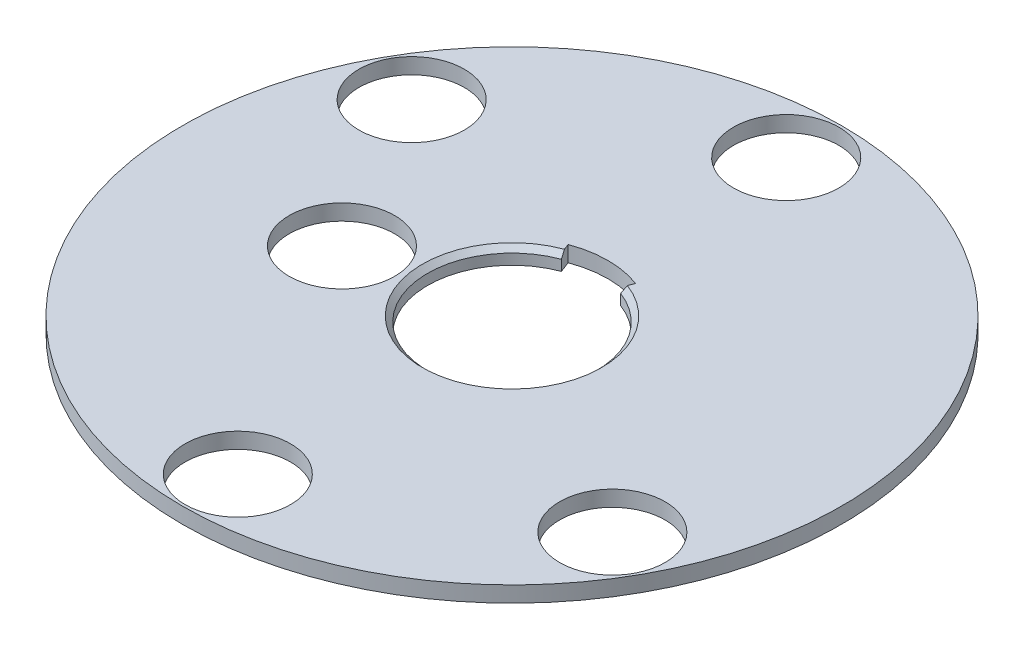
ISO-10303-21;
HEADER;
FILE_DESCRIPTION(('STEP AP214'),'2;1');
FILE_NAME('part.step','',(''),(''),'','','');
FILE_SCHEMA(('AUTOMOTIVE_DESIGN { 1 0 10303 214 1 1 1 1 }'));
ENDSEC;
DATA;
#1=APPLICATION_CONTEXT('core data for automotive mechanical design processes');
#2=APPLICATION_PROTOCOL_DEFINITION('international standard','automotive_design',2000,#1);
#3=PRODUCT_CONTEXT('',#1,'mechanical');
#4=PRODUCT('Part','Part','',(#3));
#5=PRODUCT_RELATED_PRODUCT_CATEGORY('part','',(#4));
#6=PRODUCT_DEFINITION_FORMATION('','',#4);
#7=PRODUCT_DEFINITION_CONTEXT('part definition',#1,'design');
#8=PRODUCT_DEFINITION('design','',#6,#7);
#9=PRODUCT_DEFINITION_SHAPE('','',#8);
#10=(LENGTH_UNIT() NAMED_UNIT(*) SI_UNIT(.MILLI.,.METRE.));
#11=(NAMED_UNIT(*) PLANE_ANGLE_UNIT() SI_UNIT($,.RADIAN.));
#12=(NAMED_UNIT(*) SI_UNIT($,.STERADIAN.) SOLID_ANGLE_UNIT());
#13=UNCERTAINTY_MEASURE_WITH_UNIT(LENGTH_MEASURE(1.E-05),#10,'distance_accuracy_value','');
#14=(GEOMETRIC_REPRESENTATION_CONTEXT(3) GLOBAL_UNCERTAINTY_ASSIGNED_CONTEXT((#13)) GLOBAL_UNIT_ASSIGNED_CONTEXT((#10,
#11,#12)) REPRESENTATION_CONTEXT('',''));
#15=CARTESIAN_POINT('',(0.,0.,0.));
#16=DIRECTION('',(0.,0.,1.));
#17=DIRECTION('',(1.,0.,0.));
#18=AXIS2_PLACEMENT_3D('',#15,#16,#17);
#19=CARTESIAN_POINT('',(0.,-1.5,0.));
#20=DIRECTION('',(0.,1.,0.));
#21=DIRECTION('',(0.,0.,1.));
#22=AXIS2_PLACEMENT_3D('',#19,#20,#21);
#23=CYLINDRICAL_SURFACE('',#22,31.25);
#24=CARTESIAN_POINT('',(0.,-1.5,0.));
#25=DIRECTION('',(0.,1.,0.));
#26=DIRECTION('',(0.,0.,1.));
#27=AXIS2_PLACEMENT_3D('',#24,#25,#26);
#28=CIRCLE('',#27,31.25);
#29=CARTESIAN_POINT('',(0.,-1.5,31.25));
#30=VERTEX_POINT('',#29);
#31=EDGE_CURVE('E120',#30,#30,#28,.T.);
#32=ORIENTED_EDGE('',*,*,#31,.T.);
#33=EDGE_LOOP('',(#32));
#34=FACE_BOUND('',#33,.T.);
#35=CARTESIAN_POINT('',(0.,0.,0.));
#36=DIRECTION('',(0.,1.,0.));
#37=DIRECTION('',(0.,0.,1.));
#38=AXIS2_PLACEMENT_3D('',#35,#36,#37);
#39=CIRCLE('',#38,31.25);
#40=CARTESIAN_POINT('',(0.,0.,31.25));
#41=VERTEX_POINT('',#40);
#42=EDGE_CURVE('E115',#41,#41,#39,.T.);
#43=ORIENTED_EDGE('',*,*,#42,.F.);
#44=EDGE_LOOP('',(#43));
#45=FACE_BOUND('',#44,.T.);
#46=ADVANCED_FACE('F32',(#34,#45),#23,.T.);
#47=CARTESIAN_POINT('',(0.,-1.5,0.));
#48=DIRECTION('',(0.,1.,0.));
#49=DIRECTION('',(0.,0.,1.));
#50=AXIS2_PLACEMENT_3D('',#47,#48,#49);
#51=PLANE('',#50);
#52=CARTESIAN_POINT('',(-13.8063819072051,-1.5,2.32030571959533));
#53=DIRECTION('',(0.,1.,0.));
#54=DIRECTION('',(0.,0.,1.));
#55=AXIS2_PLACEMENT_3D('',#52,#53,#54);
#56=CIRCLE('',#55,5.00000000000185);
#57=CARTESIAN_POINT('',(-13.8063819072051,-1.5,7.32030571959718));
#58=VERTEX_POINT('',#57);
#59=EDGE_CURVE('E185',#58,#58,#56,.T.);
#60=ORIENTED_EDGE('',*,*,#59,.T.);
#61=EDGE_LOOP('',(#60));
#62=FACE_BOUND('',#61,.T.);
#63=CARTESIAN_POINT('',(-22.5166604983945,-1.5,-12.9999999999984));
#64=DIRECTION('',(0.,1.,0.));
#65=DIRECTION('',(0.,0.,1.));
#66=AXIS2_PLACEMENT_3D('',#63,#64,#65);
#67=CIRCLE('',#66,5.0000000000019);
#68=CARTESIAN_POINT('',(-22.5166604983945,-1.5,-7.99999999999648));
#69=VERTEX_POINT('',#68);
#70=EDGE_CURVE('E189',#69,#69,#67,.T.);
#71=ORIENTED_EDGE('',*,*,#70,.T.);
#72=EDGE_LOOP('',(#71));
#73=FACE_BOUND('',#72,.T.);
#74=CARTESIAN_POINT('',(3.68845406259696E-12,-1.5,26.));
#75=DIRECTION('',(0.,1.,0.));
#76=DIRECTION('',(0.,0.,1.));
#77=AXIS2_PLACEMENT_3D('',#74,#75,#76);
#78=CIRCLE('',#77,5.0000000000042);
#79=CARTESIAN_POINT('',(3.68845406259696E-12,-1.5,31.0000000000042));
#80=VERTEX_POINT('',#79);
#81=EDGE_CURVE('E198',#80,#80,#78,.T.);
#82=ORIENTED_EDGE('',*,*,#81,.T.);
#83=EDGE_LOOP('',(#82));
#84=FACE_BOUND('',#83,.T.);
#85=CARTESIAN_POINT('',(22.5166604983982,-1.5,12.9999999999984));
#86=DIRECTION('',(0.,1.,0.));
#87=DIRECTION('',(0.,0.,1.));
#88=AXIS2_PLACEMENT_3D('',#85,#86,#87);
#89=CIRCLE('',#88,5.00000000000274);
#90=CARTESIAN_POINT('',(22.5166604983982,-1.5,18.0000000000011));
#91=VERTEX_POINT('',#90);
#92=EDGE_CURVE('E204',#91,#91,#89,.T.);
#93=ORIENTED_EDGE('',*,*,#92,.T.);
#94=EDGE_LOOP('',(#93));
#95=FACE_BOUND('',#94,.T.);
#96=CARTESIAN_POINT('',(0.,-1.5,-26.));
#97=DIRECTION('',(0.,1.,0.));
#98=DIRECTION('',(0.,0.,1.));
#99=AXIS2_PLACEMENT_3D('',#96,#97,#98);
#100=CIRCLE('',#99,5.);
#101=CARTESIAN_POINT('',(0.,-1.5,-21.));
#102=VERTEX_POINT('',#101);
#103=EDGE_CURVE('E105',#102,#102,#100,.T.);
#104=ORIENTED_EDGE('',*,*,#103,.T.);
#105=EDGE_LOOP('',(#104));
#106=FACE_BOUND('',#105,.T.);
#107=CARTESIAN_POINT('',(0.,-1.5,0.));
#108=DIRECTION('',(0.,1.,0.));
#109=DIRECTION('',(0.,0.,1.));
#110=AXIS2_PLACEMENT_3D('',#107,#108,#109);
#111=CIRCLE('',#110,8.);
#112=CARTESIAN_POINT('',(-2.80898753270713,-1.5,-7.49063342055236));
#113=VERTEX_POINT('',#112);
#114=CARTESIAN_POINT('',(2.80898753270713,-1.5,-7.49063342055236));
#115=VERTEX_POINT('',#114);
#116=EDGE_CURVE('E87',#113,#115,#111,.T.);
#117=ORIENTED_EDGE('',*,*,#116,.T.);
#118=DIRECTION('',(0.351123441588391,0.,-0.936329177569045));
#119=VECTOR('',#118,1.);
#120=CARTESIAN_POINT('',(3.,-1.5,-8.));
#121=LINE('',#120,#119);
#122=CARTESIAN_POINT('',(3.19522331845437,-1.5,-8.5205955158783));
#123=VERTEX_POINT('',#122);
#124=EDGE_CURVE('E80',#115,#123,#121,.T.);
#125=ORIENTED_EDGE('',*,*,#124,.T.);
#126=CARTESIAN_POINT('',(0.,-1.5,0.));
#127=DIRECTION('',(0.,1.,0.));
#128=DIRECTION('',(0.,0.,1.));
#129=AXIS2_PLACEMENT_3D('',#126,#127,#128);
#130=CIRCLE('',#129,9.1);
#131=CARTESIAN_POINT('',(-3.19522331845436,-1.5,-8.52059551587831));
#132=VERTEX_POINT('',#131);
#133=EDGE_CURVE('E91',#123,#132,#130,.T.);
#134=ORIENTED_EDGE('',*,*,#133,.T.);
#135=DIRECTION('',(0.351123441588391,0.,0.936329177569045));
#136=VECTOR('',#135,1.);
#137=CARTESIAN_POINT('',(-3.,-1.5,-8.));
#138=LINE('',#137,#136);
#139=EDGE_CURVE('E95',#132,#113,#138,.T.);
#140=ORIENTED_EDGE('',*,*,#139,.T.);
#141=EDGE_LOOP('',(#117,#125,#134,#140));
#142=FACE_BOUND('',#141,.T.);
#143=ORIENTED_EDGE('',*,*,#31,.F.);
#144=EDGE_LOOP('',(#143));
#145=FACE_BOUND('',#144,.T.);
#146=ADVANCED_FACE('F98',(#62,#73,#84,#95,#106,#142,#145),#51,.F.);
#147=CARTESIAN_POINT('',(0.,0.,0.));
#148=DIRECTION('',(0.,1.,0.));
#149=DIRECTION('',(0.,0.,1.));
#150=AXIS2_PLACEMENT_3D('',#147,#148,#149);
#151=PLANE('',#150);
#152=CARTESIAN_POINT('',(-13.8063819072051,0.,2.32030571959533));
#153=DIRECTION('',(0.,1.,0.));
#154=DIRECTION('',(0.,0.,1.));
#155=AXIS2_PLACEMENT_3D('',#152,#153,#154);
#156=CIRCLE('',#155,5.00000000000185);
#157=CARTESIAN_POINT('',(-13.8063819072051,0.,7.32030571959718));
#158=VERTEX_POINT('',#157);
#159=EDGE_CURVE('E182',#158,#158,#156,.T.);
#160=ORIENTED_EDGE('',*,*,#159,.F.);
#161=EDGE_LOOP('',(#160));
#162=FACE_BOUND('',#161,.T.);
#163=CARTESIAN_POINT('',(-22.5166604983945,0.,-12.9999999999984));
#164=DIRECTION('',(0.,1.,0.));
#165=DIRECTION('',(0.,0.,1.));
#166=AXIS2_PLACEMENT_3D('',#163,#164,#165);
#167=CIRCLE('',#166,5.0000000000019);
#168=CARTESIAN_POINT('',(-22.5166604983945,0.,-7.99999999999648));
#169=VERTEX_POINT('',#168);
#170=EDGE_CURVE('E186',#169,#169,#167,.T.);
#171=ORIENTED_EDGE('',*,*,#170,.F.);
#172=EDGE_LOOP('',(#171));
#173=FACE_BOUND('',#172,.T.);
#174=CARTESIAN_POINT('',(3.68845406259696E-12,0.,26.));
#175=DIRECTION('',(0.,1.,0.));
#176=DIRECTION('',(0.,0.,1.));
#177=AXIS2_PLACEMENT_3D('',#174,#175,#176);
#178=CIRCLE('',#177,5.0000000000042);
#179=CARTESIAN_POINT('',(3.68845406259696E-12,0.,31.0000000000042));
#180=VERTEX_POINT('',#179);
#181=EDGE_CURVE('E195',#180,#180,#178,.T.);
#182=ORIENTED_EDGE('',*,*,#181,.F.);
#183=EDGE_LOOP('',(#182));
#184=FACE_BOUND('',#183,.T.);
#185=CARTESIAN_POINT('',(22.5166604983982,0.,12.9999999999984));
#186=DIRECTION('',(0.,1.,0.));
#187=DIRECTION('',(0.,0.,1.));
#188=AXIS2_PLACEMENT_3D('',#185,#186,#187);
#189=CIRCLE('',#188,5.00000000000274);
#190=CARTESIAN_POINT('',(22.5166604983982,0.,18.0000000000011));
#191=VERTEX_POINT('',#190);
#192=EDGE_CURVE('E201',#191,#191,#189,.T.);
#193=ORIENTED_EDGE('',*,*,#192,.F.);
#194=EDGE_LOOP('',(#193));
#195=FACE_BOUND('',#194,.T.);
#196=CARTESIAN_POINT('',(0.,0.,-26.));
#197=DIRECTION('',(0.,1.,0.));
#198=DIRECTION('',(0.,0.,1.));
#199=AXIS2_PLACEMENT_3D('',#196,#197,#198);
#200=CIRCLE('',#199,5.);
#201=CARTESIAN_POINT('',(0.,0.,-21.));
#202=VERTEX_POINT('',#201);
#203=EDGE_CURVE('E206',#202,#202,#200,.T.);
#204=ORIENTED_EDGE('',*,*,#203,.F.);
#205=EDGE_LOOP('',(#204));
#206=FACE_BOUND('',#205,.T.);
#207=DIRECTION('',(0.351123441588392,0.,-0.936329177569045));
#208=VECTOR('',#207,1.);
#209=CARTESIAN_POINT('',(2.80898753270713,0.,-7.49063342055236));
#210=LINE('',#209,#208);
#211=CARTESIAN_POINT('',(2.98454925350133,0.,-7.95879800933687));
#212=VERTEX_POINT('',#211);
#213=CARTESIAN_POINT('',(3.19522331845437,0.,-8.52059551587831));
#214=VERTEX_POINT('',#213);
#215=EDGE_CURVE('E82',#212,#214,#210,.T.);
#216=ORIENTED_EDGE('',*,*,#215,.F.);
#217=CARTESIAN_POINT('',(0.,0.,0.));
#218=DIRECTION('',(0.,1.,0.));
#219=DIRECTION('',(0.,0.,1.));
#220=AXIS2_PLACEMENT_3D('',#217,#218,#219);
#221=CIRCLE('',#220,8.49999999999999);
#222=CARTESIAN_POINT('',(-2.98454925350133,0.,-7.95879800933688));
#223=VERTEX_POINT('',#222);
#224=EDGE_CURVE('E40',#212,#223,#221,.F.);
#225=ORIENTED_EDGE('',*,*,#224,.T.);
#226=DIRECTION('',(0.351123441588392,0.,0.936329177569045));
#227=VECTOR('',#226,1.);
#228=CARTESIAN_POINT('',(-2.80898753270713,0.,-7.49063342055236));
#229=LINE('',#228,#227);
#230=CARTESIAN_POINT('',(-3.19522331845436,0.,-8.52059551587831));
#231=VERTEX_POINT('',#230);
#232=EDGE_CURVE('E102',#231,#223,#229,.T.);
#233=ORIENTED_EDGE('',*,*,#232,.F.);
#234=CARTESIAN_POINT('',(0.,0.,0.));
#235=DIRECTION('',(0.,1.,0.));
#236=DIRECTION('',(0.,0.,1.));
#237=AXIS2_PLACEMENT_3D('',#234,#235,#236);
#238=CIRCLE('',#237,9.1);
#239=EDGE_CURVE('E110',#214,#231,#238,.T.);
#240=ORIENTED_EDGE('',*,*,#239,.F.);
#241=EDGE_LOOP('',(#216,#225,#233,#240));
#242=FACE_BOUND('',#241,.T.);
#243=ORIENTED_EDGE('',*,*,#42,.T.);
#244=EDGE_LOOP('',(#243));
#245=FACE_BOUND('',#244,.T.);
#246=ADVANCED_FACE('F135',(#162,#173,#184,#195,#206,#242,#245),#151,.T.);
#247=CARTESIAN_POINT('',(2.80898753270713,-1.5,-7.49063342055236));
#248=DIRECTION('',(0.936329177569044,0.,0.351123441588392));
#249=DIRECTION('',(0.351123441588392,0.,-0.936329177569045));
#250=AXIS2_PLACEMENT_3D('',#247,#248,#249);
#251=PLANE('',#250);
#252=DIRECTION('',(0.,1.,0.));
#253=VECTOR('',#252,1.);
#254=CARTESIAN_POINT('',(2.80898753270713,-1.5,-7.49063342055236));
#255=LINE('',#254,#253);
#256=CARTESIAN_POINT('',(2.80898753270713,-0.49999999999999,-7.49063342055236));
#257=VERTEX_POINT('',#256);
#258=EDGE_CURVE('E113',#115,#257,#255,.T.);
#259=ORIENTED_EDGE('',*,*,#258,.T.);
#260=DIRECTION('',(0.24828176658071,0.707106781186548,-0.662084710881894));
#261=VECTOR('',#260,1.);
#262=CARTESIAN_POINT('',(0.,-8.49999999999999,0.));
#263=LINE('',#262,#261);
#264=EDGE_CURVE('E54',#257,#212,#263,.T.);
#265=ORIENTED_EDGE('',*,*,#264,.T.);
#266=ORIENTED_EDGE('',*,*,#215,.T.);
#267=DIRECTION('',(0.,1.,0.));
#268=VECTOR('',#267,1.);
#269=CARTESIAN_POINT('',(3.19522331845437,-1.5,-8.5205955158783));
#270=LINE('',#269,#268);
#271=EDGE_CURVE('E76',#123,#214,#270,.T.);
#272=ORIENTED_EDGE('',*,*,#271,.F.);
#273=ORIENTED_EDGE('',*,*,#124,.F.);
#274=EDGE_LOOP('',(#259,#265,#266,#272,#273));
#275=FACE_BOUND('',#274,.T.);
#276=ADVANCED_FACE('F78',(#275),#251,.F.);
#277=CARTESIAN_POINT('',(0.,-1.5,0.));
#278=DIRECTION('',(0.,1.,0.));
#279=DIRECTION('',(0.,0.,1.));
#280=AXIS2_PLACEMENT_3D('',#277,#278,#279);
#281=CYLINDRICAL_SURFACE('',#280,8.);
#282=DIRECTION('',(0.,1.,0.));
#283=VECTOR('',#282,1.);
#284=CARTESIAN_POINT('',(-2.80898753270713,-1.5,-7.49063342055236));
#285=LINE('',#284,#283);
#286=CARTESIAN_POINT('',(-2.80898753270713,-0.49999999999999,-7.49063342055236));
#287=VERTEX_POINT('',#286);
#288=EDGE_CURVE('E116',#113,#287,#285,.T.);
#289=ORIENTED_EDGE('',*,*,#288,.T.);
#290=CARTESIAN_POINT('',(0.,-0.499999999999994,0.));
#291=DIRECTION('',(0.,1.,0.));
#292=DIRECTION('',(0.,0.,1.));
#293=AXIS2_PLACEMENT_3D('',#290,#291,#292);
#294=CIRCLE('',#293,8.);
#295=EDGE_CURVE('E123',#287,#257,#294,.T.);
#296=ORIENTED_EDGE('',*,*,#295,.T.);
#297=ORIENTED_EDGE('',*,*,#258,.F.);
#298=ORIENTED_EDGE('',*,*,#116,.F.);
#299=EDGE_LOOP('',(#289,#296,#297,#298));
#300=FACE_BOUND('',#299,.T.);
#301=ADVANCED_FACE('F130',(#300),#281,.F.);
#302=CARTESIAN_POINT('',(-2.80898753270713,-1.5,-7.49063342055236));
#303=DIRECTION('',(-0.936329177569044,0.,0.351123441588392));
#304=DIRECTION('',(0.351123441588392,0.,0.936329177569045));
#305=AXIS2_PLACEMENT_3D('',#302,#303,#304);
#306=PLANE('',#305);
#307=ORIENTED_EDGE('',*,*,#232,.T.);
#308=DIRECTION('',(0.24828176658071,-0.707106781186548,0.662084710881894));
#309=VECTOR('',#308,1.);
#310=CARTESIAN_POINT('',(0.,-8.49999999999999,0.));
#311=LINE('',#310,#309);
#312=EDGE_CURVE('E11',#223,#287,#311,.T.);
#313=ORIENTED_EDGE('',*,*,#312,.T.);
#314=ORIENTED_EDGE('',*,*,#288,.F.);
#315=ORIENTED_EDGE('',*,*,#139,.F.);
#316=DIRECTION('',(0.,1.,0.));
#317=VECTOR('',#316,1.);
#318=CARTESIAN_POINT('',(-3.19522331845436,-1.5,-8.52059551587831));
#319=LINE('',#318,#317);
#320=EDGE_CURVE('E86',#132,#231,#319,.T.);
#321=ORIENTED_EDGE('',*,*,#320,.T.);
#322=EDGE_LOOP('',(#307,#313,#314,#315,#321));
#323=FACE_BOUND('',#322,.T.);
#324=ADVANCED_FACE('F134',(#323),#306,.F.);
#325=CARTESIAN_POINT('',(0.,-1.5,0.));
#326=DIRECTION('',(0.,1.,0.));
#327=DIRECTION('',(0.,0.,1.));
#328=AXIS2_PLACEMENT_3D('',#325,#326,#327);
#329=CYLINDRICAL_SURFACE('',#328,9.1);
#330=ORIENTED_EDGE('',*,*,#239,.T.);
#331=ORIENTED_EDGE('',*,*,#320,.F.);
#332=ORIENTED_EDGE('',*,*,#133,.F.);
#333=ORIENTED_EDGE('',*,*,#271,.T.);
#334=EDGE_LOOP('',(#330,#331,#332,#333));
#335=FACE_BOUND('',#334,.T.);
#336=ADVANCED_FACE('F92',(#335),#329,.F.);
#337=CARTESIAN_POINT('',(0.,-0.499999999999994,0.));
#338=DIRECTION('',(0.,1.,0.));
#339=DIRECTION('',(0.,0.,1.));
#340=AXIS2_PLACEMENT_3D('',#337,#338,#339);
#341=CONICAL_SURFACE('',#340,8.,0.785398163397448);
#342=ORIENTED_EDGE('',*,*,#312,.F.);
#343=ORIENTED_EDGE('',*,*,#224,.F.);
#344=ORIENTED_EDGE('',*,*,#264,.F.);
#345=ORIENTED_EDGE('',*,*,#295,.F.);
#346=EDGE_LOOP('',(#342,#343,#344,#345));
#347=FACE_BOUND('',#346,.T.);
#348=ADVANCED_FACE('F34',(#347),#341,.F.);
#349=CARTESIAN_POINT('',(0.,-10.,-26.));
#350=DIRECTION('',(0.,1.,0.));
#351=DIRECTION('',(0.,0.,1.));
#352=AXIS2_PLACEMENT_3D('',#349,#350,#351);
#353=CYLINDRICAL_SURFACE('',#352,5.);
#354=ORIENTED_EDGE('',*,*,#203,.T.);
#355=EDGE_LOOP('',(#354));
#356=FACE_BOUND('',#355,.T.);
#357=ORIENTED_EDGE('',*,*,#103,.F.);
#358=EDGE_LOOP('',(#357));
#359=FACE_BOUND('',#358,.T.);
#360=ADVANCED_FACE('F158',(#356,#359),#353,.F.);
#361=CARTESIAN_POINT('',(22.5166604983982,-10.,12.9999999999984));
#362=DIRECTION('',(0.,1.,0.));
#363=DIRECTION('',(0.,0.,1.));
#364=AXIS2_PLACEMENT_3D('',#361,#362,#363);
#365=CYLINDRICAL_SURFACE('',#364,5.00000000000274);
#366=ORIENTED_EDGE('',*,*,#192,.T.);
#367=EDGE_LOOP('',(#366));
#368=FACE_BOUND('',#367,.T.);
#369=ORIENTED_EDGE('',*,*,#92,.F.);
#370=EDGE_LOOP('',(#369));
#371=FACE_BOUND('',#370,.T.);
#372=ADVANCED_FACE('F161',(#368,#371),#365,.F.);
#373=CARTESIAN_POINT('',(3.68845406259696E-12,-10.,26.));
#374=DIRECTION('',(0.,1.,0.));
#375=DIRECTION('',(0.,0.,1.));
#376=AXIS2_PLACEMENT_3D('',#373,#374,#375);
#377=CYLINDRICAL_SURFACE('',#376,5.0000000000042);
#378=ORIENTED_EDGE('',*,*,#181,.T.);
#379=EDGE_LOOP('',(#378));
#380=FACE_BOUND('',#379,.T.);
#381=ORIENTED_EDGE('',*,*,#81,.F.);
#382=EDGE_LOOP('',(#381));
#383=FACE_BOUND('',#382,.T.);
#384=ADVANCED_FACE('F165',(#380,#383),#377,.F.);
#385=CARTESIAN_POINT('',(-22.5166604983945,-10.,-12.9999999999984));
#386=DIRECTION('',(0.,1.,0.));
#387=DIRECTION('',(0.,0.,1.));
#388=AXIS2_PLACEMENT_3D('',#385,#386,#387);
#389=CYLINDRICAL_SURFACE('',#388,5.0000000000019);
#390=ORIENTED_EDGE('',*,*,#170,.T.);
#391=EDGE_LOOP('',(#390));
#392=FACE_BOUND('',#391,.T.);
#393=ORIENTED_EDGE('',*,*,#70,.F.);
#394=EDGE_LOOP('',(#393));
#395=FACE_BOUND('',#394,.T.);
#396=ADVANCED_FACE('F169',(#392,#395),#389,.F.);
#397=CARTESIAN_POINT('',(-13.8063819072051,-10.,2.32030571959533));
#398=DIRECTION('',(0.,1.,0.));
#399=DIRECTION('',(0.,0.,1.));
#400=AXIS2_PLACEMENT_3D('',#397,#398,#399);
#401=CYLINDRICAL_SURFACE('',#400,5.00000000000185);
#402=ORIENTED_EDGE('',*,*,#159,.T.);
#403=EDGE_LOOP('',(#402));
#404=FACE_BOUND('',#403,.T.);
#405=ORIENTED_EDGE('',*,*,#59,.F.);
#406=EDGE_LOOP('',(#405));
#407=FACE_BOUND('',#406,.T.);
#408=ADVANCED_FACE('F173',(#404,#407),#401,.F.);
#409=CLOSED_SHELL('',(#46,#146,#246,#276,#301,#324,#336,#348,#360,#372,#384,#396,#408));
#410=MANIFOLD_SOLID_BREP('B2',#409);
#411=ADVANCED_BREP_SHAPE_REPRESENTATION('',(#18,#410),#14);
#412=SHAPE_DEFINITION_REPRESENTATION(#9,#411);
ENDSEC;
END-ISO-10303-21;
